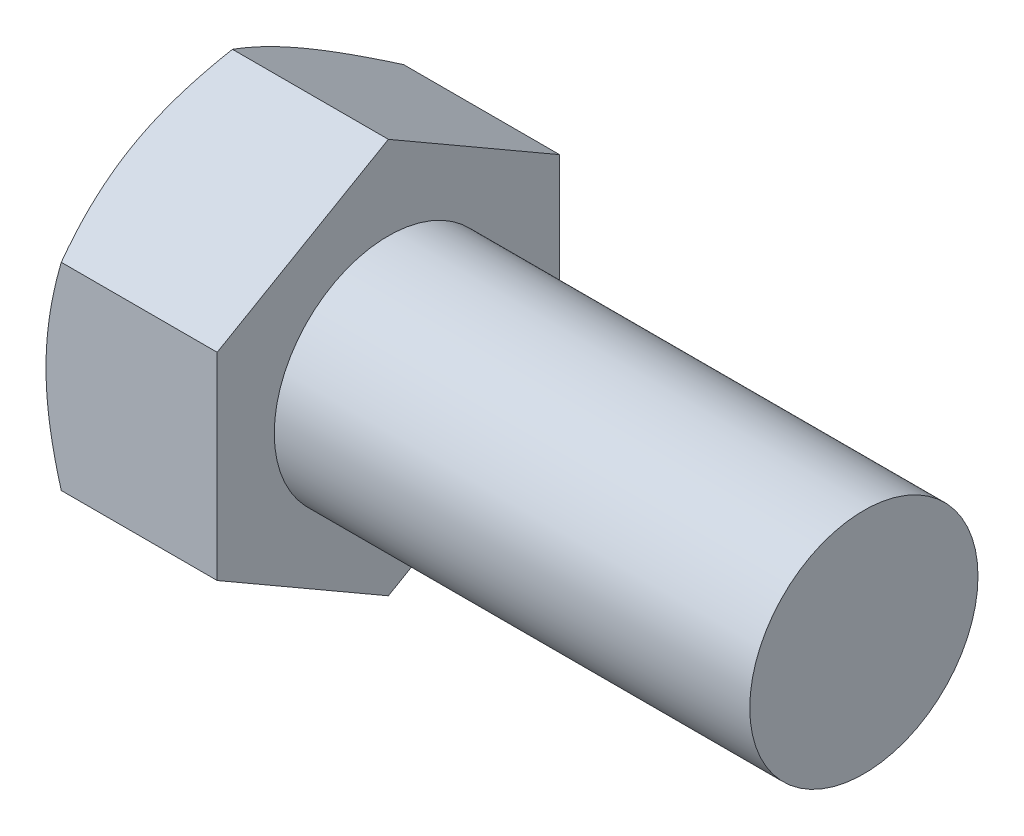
from build123d import *

# Parameters (mm, degrees)
SKETCH2_R     = 10.496535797
HEX_DIE_DEPTH = 9
SKETCH4_R     = 7.875
INDENT_DEPTH  = 1.125


with BuildPart() as part:
    # BodySke → Base-Revolve (revolve)
    with BuildSketch(Plane.XY, mode=Mode.PRIVATE) as base_revolve_sk:
        Polygon((9, 6), (9, 10.3926097), (0.804023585, 10.3926097), (0, 9), (0, 0), (34, 0), (34, 6), align=None)
    revolve(base_revolve_sk.sketch.rotate(Axis((-25.4, 0, 0), (1, 0, 0)), 90), axis=Axis((-25.4, 0, 0), (1, 0, 0)))

    # Sketch2 → Hex-Die (cut)
    with BuildSketch(Plane(origin=(0, 0, 0), x_dir=(0, 0, -1), z_dir=(1, 0, 0))):
        Circle(SKETCH2_R)
        Polygon((-9, 5.196152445), (0, 10.392304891), (9, 5.196152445), (9, -5.196152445), (0, -10.392304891), (-9, -5.196152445), align=None, mode=Mode.SUBTRACT)
    extrude(amount=HEX_DIE_DEPTH, mode=Mode.SUBTRACT)

    # Sketch4 → Indent (cut)
    with BuildSketch(Plane(origin=(0, 0, 0), x_dir=(0, 0, -1), z_dir=(1, 0, 0))):
        Circle(SKETCH4_R)
    extrude(amount=INDENT_DEPTH, mode=Mode.SUBTRACT)


solid = part.part
